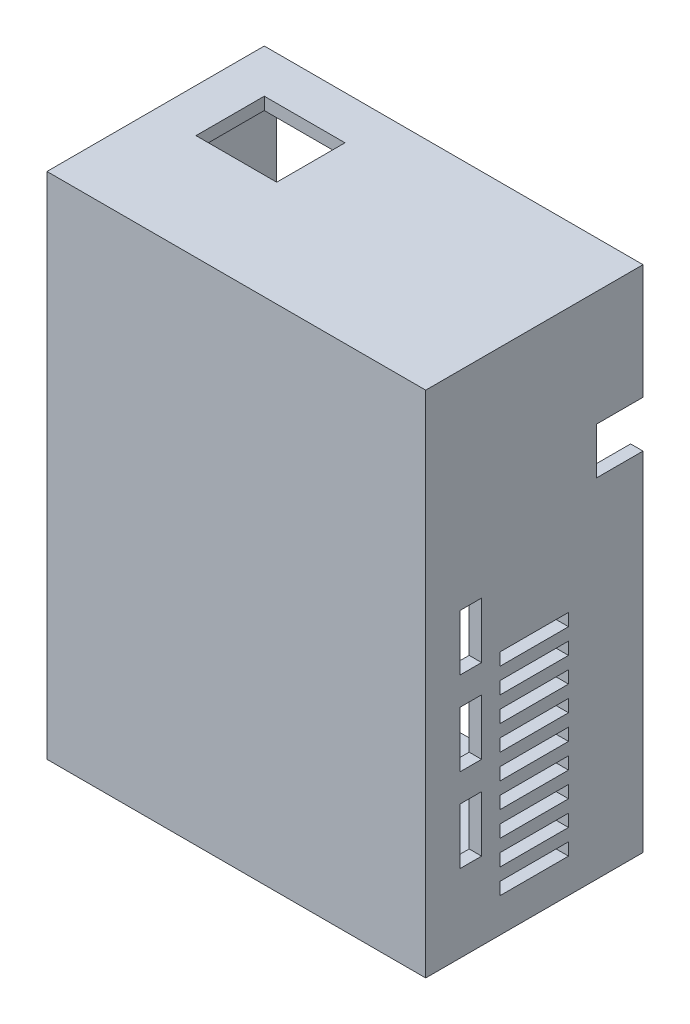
from build123d import *

# Parameters (mm, degrees)
CROQUIS1_W              = 61
CROQUIS1_H              = 82
SALIENTE_EXTRUIR1_DEPTH = 35
CROQUIS2_W              = 57
CROQUIS2_H              = 78
CORTAR_EXTRUIR1_DEPTH   = 33
CROQUIS3_W              = 4
CROQUIS3_H              = 4
SALIENTE_EXTRUIR2_DEPTH = 10
CROQUIS4_R              = 1.5
CORTAR_EXTRUIR2_DEPTH   = 1.5
CROQUIS5_W              = 4
CROQUIS5_H              = 4
CROQUIS5_R              = 0.6
CROQUIS5_W_2            = 5
CROQUIS5_H_2            = 5
CROQUIS5_R_2            = 1
SALIENTE_EXTRUIR3_DEPTH = 4
CROQUIS7_R              = 1
CORTAR_EXTRUIR3_DEPTH   = 6
CROQUIS10_R             = 1
CORTAR_EXTRUIR4_DEPTH   = 6
CROQUIS11_W             = 7
CROQUIS11_H             = 7
CORTAR_EXTRUIR8_DEPTH   = 6
CROQUIS16_W             = 7.497399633
CROQUIS16_H             = 7.5
CORTAR_EXTRUIR9_DEPTH   = 6
CROQUIS17_W             = 11
CROQUIS17_H             = 2
CORTAR_EXTRUIR10_DEPTH  = 70
CROQUIS18_W             = 8
CROQUIS18_H             = 6
CROQUIS18_W_2           = 10
CROQUIS18_H_2           = 8
CROQUIS18_W_3           = 4
CROQUIS18_H_3           = 4
CORTAR_EXTRUIR11_DEPTH  = 7
CROQUIS20_W             = 13
CROQUIS20_H             = 11
CORTAR_EXTRUIR12_DEPTH  = 10
CROQUIS21_W             = 3.5
CROQUIS21_H             = 9
CORTAR_EXTRUIR13_DEPTH  = 2


with BuildPart() as part:
    # Croquis1 → Saliente-Extruir1 (new body)
    with BuildSketch(Plane.XY):
        with Locations((-34.346097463, 15.634732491)):
            Rectangle(CROQUIS1_W, CROQUIS1_H)
    extrude(amount=SALIENTE_EXTRUIR1_DEPTH)

    # Croquis2 → Cortar-Extruir1 (cut)
    with BuildSketch(Plane(origin=(0, 0, 0), x_dir=(-1, 0, 0), z_dir=(0, 0, -1))):
        with Locations((34.346097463, 15.634732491)):
            Rectangle(CROQUIS2_W, CROQUIS2_H)
    extrude(amount=-CORTAR_EXTRUIR1_DEPTH, mode=Mode.SUBTRACT)

    # Croquis3 → Saliente-Extruir2 (add)
    with BuildSketch(Plane(origin=(0, 0, 0), x_dir=(-1, 0, 0), z_dir=(0, 0, -1))):
        with Locations((62.846097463, 54.634732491)):
            Rectangle(CROQUIS3_W, CROQUIS3_H)
        with Locations((5.846097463, 54.634732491)):
            Rectangle(CROQUIS3_W, CROQUIS3_H)
        with Locations((5.846097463, -23.365267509)):
            Rectangle(CROQUIS3_W, CROQUIS3_H)
        with Locations((62.846097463, -23.365267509)):
            Rectangle(CROQUIS3_W, CROQUIS3_H)
    extrude(amount=-SALIENTE_EXTRUIR2_DEPTH)

    # Croquis4 → Cortar-Extruir2 (cut)
    with BuildSketch(Plane(origin=(0, 0, 33), x_dir=(-1, 0, 0), z_dir=(0, 0, -1))):
        with Locations((56.846097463, -2.365267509)):
            Circle(CROQUIS4_R)
        with Locations((11.846097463, -2.865267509)):
            Circle(CROQUIS4_R)
        with Locations((56.846097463, 42.134732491)):
            Circle(CROQUIS4_R)
        with Locations((11.846097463, 42.134732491)):
            Circle(CROQUIS4_R)
    extrude(amount=-CORTAR_EXTRUIR2_DEPTH, mode=Mode.SUBTRACT)

    # Croquis5 → Saliente-Extruir3 (add)
    # profile 1 of 8: a face of its own
    with BuildSketch(Plane(origin=(0, 0, 33), x_dir=(-1, 0, 0), z_dir=(0, 0, -1))):
        with Locations((13.846097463, 34.134732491)):
            Rectangle(CROQUIS5_W, CROQUIS5_H)
        with Locations((14.346097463, 34.634732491)):
            Circle(CROQUIS5_R, mode=Mode.SUBTRACT)
    # profile 2 of 8: a face of its own
    with BuildSketch(Plane(origin=(0, 0, 33), x_dir=(-1, 0, 0), z_dir=(0, 0, -1))):
        with Locations((56.846097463, -17.365267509)):
            Rectangle(CROQUIS5_W_2, CROQUIS5_H_2)
        with Locations((56.846097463, -17.365267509)):
            Circle(CROQUIS5_R_2, mode=Mode.SUBTRACT)
    # profile 3 of 8: a face of its own
    with BuildSketch(Plane(origin=(0, 0, 33), x_dir=(-1, 0, 0), z_dir=(0, 0, -1))):
        with Locations((11.846097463, -17.365267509)):
            Rectangle(CROQUIS5_W_2, CROQUIS5_H_2)
        with Locations((11.846097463, -17.365267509)):
            Circle(CROQUIS5_R_2, mode=Mode.SUBTRACT)
    # profile 4 of 8: a face of its own
    with BuildSketch(Plane(origin=(0, 0, 33), x_dir=(-1, 0, 0), z_dir=(0, 0, -1))):
        with Locations((11.846097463, 27.634732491)):
            Rectangle(CROQUIS5_W_2, CROQUIS5_H_2)
        with Locations((11.846097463, 27.634732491)):
            Circle(CROQUIS5_R_2, mode=Mode.SUBTRACT)
    # profile 5 of 8: a face of its own
    with BuildSketch(Plane(origin=(0, 0, 33), x_dir=(-1, 0, 0), z_dir=(0, 0, -1))):
        with Locations((56.846097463, 27.634732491)):
            Rectangle(CROQUIS5_W_2, CROQUIS5_H_2)
        with Locations((56.846097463, 27.634732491)):
            Circle(CROQUIS5_R_2, mode=Mode.SUBTRACT)
    # profile 6 of 8: a face of its own
    with BuildSketch(Plane(origin=(0, 0, 33), x_dir=(-1, 0, 0), z_dir=(0, 0, -1))):
        with Locations((13.846097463, 50.134732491)):
            Rectangle(CROQUIS5_W, CROQUIS5_H)
        with Locations((14.346097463, 49.634732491)):
            Circle(CROQUIS5_R, mode=Mode.SUBTRACT)
    # profile 7 of 8: a face of its own
    with BuildSketch(Plane(origin=(0, 0, 33), x_dir=(-1, 0, 0), z_dir=(0, 0, -1))):
        with Locations((54.846097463, 50.134732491)):
            Rectangle(CROQUIS5_W, CROQUIS5_H)
        with Locations((54.346097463, 49.634732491)):
            Circle(CROQUIS5_R, mode=Mode.SUBTRACT)
    # profile 8 of 8: a face of its own
    with BuildSketch(Plane(origin=(0, 0, 33), x_dir=(-1, 0, 0), z_dir=(0, 0, -1))):
        with Locations((54.846097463, 34.134732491)):
            Rectangle(CROQUIS5_W, CROQUIS5_H)
        with Locations((54.346097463, 34.634732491)):
            Circle(CROQUIS5_R, mode=Mode.SUBTRACT)
    extrude(amount=SALIENTE_EXTRUIR3_DEPTH)

    # Croquis7 → Cortar-Extruir3 (cut)
    with BuildSketch(Plane(origin=(0, 0, 0), x_dir=(-1, 0, 0), z_dir=(0, 0, -1))):
        with Locations((5.846097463, -23.365267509)):
            Circle(CROQUIS7_R)
    extrude(amount=-CORTAR_EXTRUIR3_DEPTH, mode=Mode.SUBTRACT)

    # Croquis10 → Cortar-Extruir4 (cut)
    with BuildSketch(Plane(origin=(0, 0, 0), x_dir=(-1, 0, 0), z_dir=(0, 0, -1))):
        with Locations((62.846097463, -23.365267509)):
            Circle(CROQUIS10_R)
        with Locations((5.846097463, 54.634732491)):
            Circle(CROQUIS10_R)
        with Locations((62.846097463, 54.634732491)):
            Circle(CROQUIS10_R)
    extrude(amount=-CORTAR_EXTRUIR4_DEPTH, mode=Mode.SUBTRACT)

    # Croquis11 → Cortar-Extruir8 (cut)
    with BuildSketch(Plane.ZY.offset(64.846097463)):
        with Locations((3.5, 5.134732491)):
            Rectangle(CROQUIS11_W, CROQUIS11_H)
    extrude(amount=-CORTAR_EXTRUIR8_DEPTH, mode=Mode.SUBTRACT)

    # Croquis16 → Cortar-Extruir9 (cut)
    with BuildSketch(Plane(origin=(-3.846097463, 0, 0), x_dir=(0, 0, -1), z_dir=(1, 0, 0))):
        with Locations((-3.748699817, 34.384732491)):
            Rectangle(CROQUIS16_W, CROQUIS16_H)
    extrude(amount=-CORTAR_EXTRUIR9_DEPTH, mode=Mode.SUBTRACT)

    # Croquis17 → Cortar-Extruir10 (cut)
    with BuildSketch(Plane.ZY.offset(64.846097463)):
        with Locations((17.5, -14.865267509)):
            Rectangle(CROQUIS17_W, CROQUIS17_H)
        with Locations((17.5, -18.865267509)):
            Rectangle(CROQUIS17_W, CROQUIS17_H)
        with Locations((17.5, -10.865267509)):
            Rectangle(CROQUIS17_W, CROQUIS17_H)
        with Locations((17.5, -6.865267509)):
            Rectangle(CROQUIS17_W, CROQUIS17_H)
        with Locations((17.5, -2.865267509)):
            Rectangle(CROQUIS17_W, CROQUIS17_H)
        with Locations((17.5, 1.134732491)):
            Rectangle(CROQUIS17_W, CROQUIS17_H)
        with Locations((17.5, 5.134732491)):
            Rectangle(CROQUIS17_W, CROQUIS17_H)
        with Locations((17.5, 9.134732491)):
            Rectangle(CROQUIS17_W, CROQUIS17_H)
        with Locations((17.5, 13.134732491)):
            Rectangle(CROQUIS17_W, CROQUIS17_H)
    extrude(amount=-CORTAR_EXTRUIR10_DEPTH, mode=Mode.SUBTRACT)

    # Croquis18 → Cortar-Extruir11 (cut)
    with BuildSketch(Plane.XZ.offset(25.365267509)):
        with Locations((-34.346097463, 18)):
            Rectangle(CROQUIS18_W, CROQUIS18_H)
        with Locations((-46.346097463, 25)):
            Rectangle(CROQUIS18_W_2, CROQUIS18_H_2)
        with Locations((-12.846097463, 9)):
            Rectangle(CROQUIS18_W_3, CROQUIS18_H_3)
    extrude(amount=-CORTAR_EXTRUIR11_DEPTH, mode=Mode.SUBTRACT)

    # Croquis20 → Cortar-Extruir12 (cut)
    with BuildSketch(Plane(origin=(0, 56.634732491, 0), x_dir=(-1, 0, 0), z_dir=(0, 1, 0))):
        with Locations((51.346097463, 12.5)):
            Rectangle(CROQUIS20_W, CROQUIS20_H)
    extrude(amount=-CORTAR_EXTRUIR12_DEPTH, mode=Mode.SUBTRACT)

    # Croquis21 → Cortar-Extruir13 (cut)
    with BuildSketch(Plane(origin=(-3.846097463, 0, 0), x_dir=(0, 0, -1), z_dir=(1, 0, 0))):
        with Locations((-27.75, -8.365267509)):
            Rectangle(CROQUIS21_W, CROQUIS21_H)
        with Locations((-27.75, 5.134732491)):
            Rectangle(CROQUIS21_W, CROQUIS21_H)
        with Locations((-27.75, 18.634732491)):
            Rectangle(CROQUIS21_W, CROQUIS21_H)
    extrude(amount=-CORTAR_EXTRUIR13_DEPTH, mode=Mode.SUBTRACT)


solid = part.part
